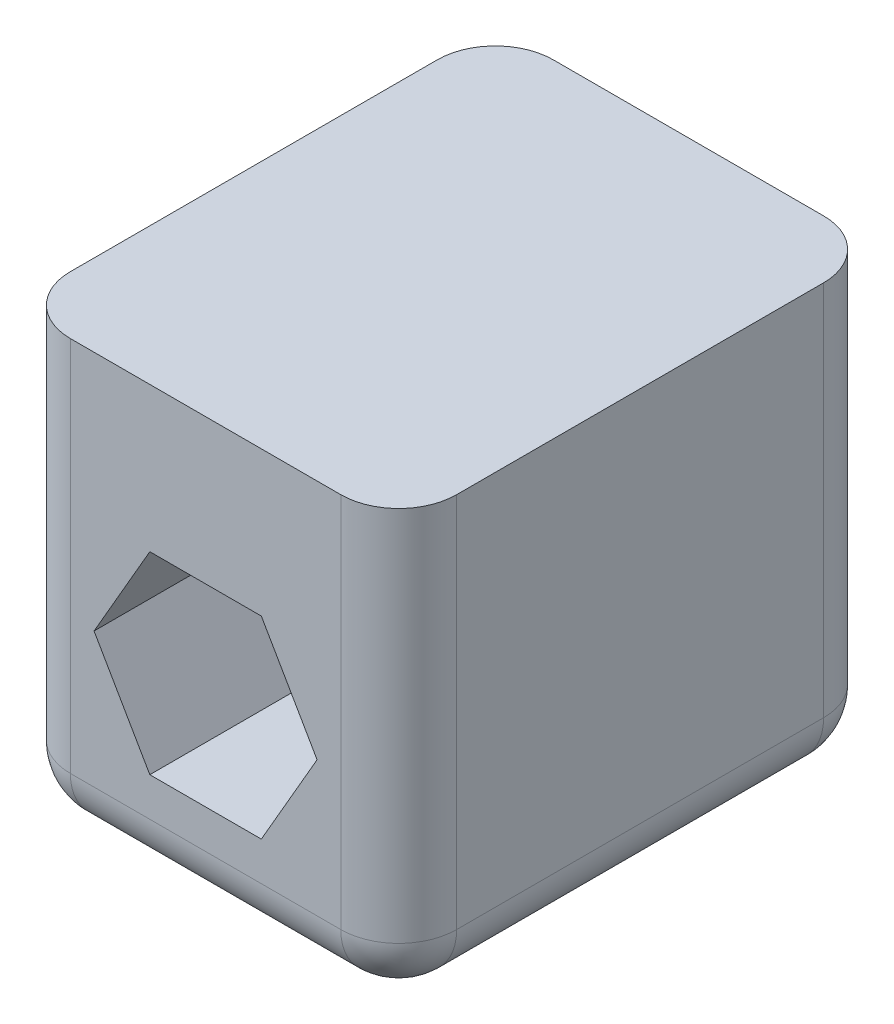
ISO-10303-21;
HEADER;
FILE_DESCRIPTION(('STEP AP214'),'2;1');
FILE_NAME('part.step','',(''),(''),'','','');
FILE_SCHEMA(('AUTOMOTIVE_DESIGN { 1 0 10303 214 1 1 1 1 }'));
ENDSEC;
DATA;
#1=APPLICATION_CONTEXT('core data for automotive mechanical design processes');
#2=APPLICATION_PROTOCOL_DEFINITION('international standard','automotive_design',2000,#1);
#3=PRODUCT_CONTEXT('',#1,'mechanical');
#4=PRODUCT('Part','Part','',(#3));
#5=PRODUCT_RELATED_PRODUCT_CATEGORY('part','',(#4));
#6=PRODUCT_DEFINITION_FORMATION('','',#4);
#7=PRODUCT_DEFINITION_CONTEXT('part definition',#1,'design');
#8=PRODUCT_DEFINITION('design','',#6,#7);
#9=PRODUCT_DEFINITION_SHAPE('','',#8);
#10=(LENGTH_UNIT() NAMED_UNIT(*) SI_UNIT(.MILLI.,.METRE.));
#11=(NAMED_UNIT(*) PLANE_ANGLE_UNIT() SI_UNIT($,.RADIAN.));
#12=(NAMED_UNIT(*) SI_UNIT($,.STERADIAN.) SOLID_ANGLE_UNIT());
#13=UNCERTAINTY_MEASURE_WITH_UNIT(LENGTH_MEASURE(1.E-05),#10,'distance_accuracy_value','');
#14=(GEOMETRIC_REPRESENTATION_CONTEXT(3) GLOBAL_UNCERTAINTY_ASSIGNED_CONTEXT((#13)) GLOBAL_UNIT_ASSIGNED_CONTEXT((#10,
#11,#12)) REPRESENTATION_CONTEXT('',''));
#15=CARTESIAN_POINT('',(0.,0.,0.));
#16=DIRECTION('',(0.,0.,1.));
#17=DIRECTION('',(1.,0.,0.));
#18=AXIS2_PLACEMENT_3D('',#15,#16,#17);
#19=CARTESIAN_POINT('',(0.,0.,25.));
#20=DIRECTION('',(0.,0.,-1.));
#21=DIRECTION('',(-1.,0.,0.));
#22=AXIS2_PLACEMENT_3D('',#19,#20,#21);
#23=CYLINDRICAL_SURFACE('',#22,3.2);
#24=CARTESIAN_POINT('',(0.,0.,0.));
#25=DIRECTION('',(0.,0.,1.));
#26=DIRECTION('',(1.,0.,0.));
#27=AXIS2_PLACEMENT_3D('',#24,#25,#26);
#28=CIRCLE('',#27,3.2);
#29=CARTESIAN_POINT('',(3.2,0.,0.));
#30=VERTEX_POINT('',#29);
#31=EDGE_CURVE('E235',#30,#30,#28,.T.);
#32=ORIENTED_EDGE('',*,*,#31,.F.);
#33=EDGE_LOOP('',(#32));
#34=FACE_BOUND('',#33,.T.);
#35=CARTESIAN_POINT('',(0.,0.,15.));
#36=DIRECTION('',(0.,0.,1.));
#37=DIRECTION('',(1.,0.,0.));
#38=AXIS2_PLACEMENT_3D('',#35,#36,#37);
#39=CIRCLE('',#38,3.2);
#40=CARTESIAN_POINT('',(3.2,0.,15.));
#41=VERTEX_POINT('',#40);
#42=EDGE_CURVE('E223',#41,#41,#39,.T.);
#43=ORIENTED_EDGE('',*,*,#42,.T.);
#44=EDGE_LOOP('',(#43));
#45=FACE_BOUND('',#44,.T.);
#46=ADVANCED_FACE('F45',(#34,#45),#23,.F.);
#47=CARTESIAN_POINT('',(0.,0.,25.));
#48=DIRECTION('',(0.,0.,-1.));
#49=DIRECTION('',(-1.,0.,0.));
#50=AXIS2_PLACEMENT_3D('',#47,#48,#49);
#51=PLANE('',#50);
#52=DIRECTION('',(-0.999999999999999,-4.97530298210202E-08,0.));
#53=VECTOR('',#52,1.);
#54=CARTESIAN_POINT('',(-10.,12.4999995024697,25.));
#55=LINE('',#54,#53);
#56=CARTESIAN_POINT('',(7.,12.5000003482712,25.));
#57=VERTEX_POINT('',#56);
#58=CARTESIAN_POINT('',(-7.,12.4999996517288,25.));
#59=VERTEX_POINT('',#58);
#60=EDGE_CURVE('E240',#57,#59,#55,.T.);
#61=ORIENTED_EDGE('',*,*,#60,.T.);
#62=DIRECTION('',(0.,-1.,0.));
#63=VECTOR('',#62,1.);
#64=CARTESIAN_POINT('',(-7.,0.,25.));
#65=LINE('',#64,#63);
#66=CARTESIAN_POINT('',(-7.,-7.,25.));
#67=VERTEX_POINT('',#66);
#68=EDGE_CURVE('E11',#59,#67,#65,.T.);
#69=ORIENTED_EDGE('',*,*,#68,.T.);
#70=DIRECTION('',(1.,0.,0.));
#71=VECTOR('',#70,1.);
#72=CARTESIAN_POINT('',(0.,-7.,25.));
#73=LINE('',#72,#71);
#74=CARTESIAN_POINT('',(7.,-7.,25.));
#75=VERTEX_POINT('',#74);
#76=EDGE_CURVE('E62',#67,#75,#73,.T.);
#77=ORIENTED_EDGE('',*,*,#76,.T.);
#78=DIRECTION('',(0.,1.,0.));
#79=VECTOR('',#78,1.);
#80=CARTESIAN_POINT('',(7.,0.,25.));
#81=LINE('',#80,#79);
#82=EDGE_CURVE('E55',#75,#57,#81,.T.);
#83=ORIENTED_EDGE('',*,*,#82,.T.);
#84=EDGE_LOOP('',(#61,#69,#77,#83));
#85=FACE_BOUND('',#84,.T.);
#86=DIRECTION('',(-0.5,0.866025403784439,0.));
#87=VECTOR('',#86,1.);
#88=CARTESIAN_POINT('',(5.77350269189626,0.,25.));
#89=LINE('',#88,#87);
#90=CARTESIAN_POINT('',(5.77350269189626,0.,25.));
#91=VERTEX_POINT('',#90);
#92=CARTESIAN_POINT('',(2.88675134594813,5.,25.));
#93=VERTEX_POINT('',#92);
#94=EDGE_CURVE('E206',#91,#93,#89,.T.);
#95=ORIENTED_EDGE('',*,*,#94,.F.);
#96=DIRECTION('',(0.5,0.866025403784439,0.));
#97=VECTOR('',#96,1.);
#98=CARTESIAN_POINT('',(2.88675134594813,-5.,25.));
#99=LINE('',#98,#97);
#100=CARTESIAN_POINT('',(2.88675134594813,-5.,25.));
#101=VERTEX_POINT('',#100);
#102=EDGE_CURVE('E165',#101,#91,#99,.T.);
#103=ORIENTED_EDGE('',*,*,#102,.F.);
#104=DIRECTION('',(1.,0.,0.));
#105=VECTOR('',#104,1.);
#106=CARTESIAN_POINT('',(-2.88675134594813,-5.,25.));
#107=LINE('',#106,#105);
#108=CARTESIAN_POINT('',(-2.88675134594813,-5.,25.));
#109=VERTEX_POINT('',#108);
#110=EDGE_CURVE('E186',#109,#101,#107,.T.);
#111=ORIENTED_EDGE('',*,*,#110,.F.);
#112=DIRECTION('',(0.5,-0.866025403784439,0.));
#113=VECTOR('',#112,1.);
#114=CARTESIAN_POINT('',(-5.77350269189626,0.,25.));
#115=LINE('',#114,#113);
#116=CARTESIAN_POINT('',(-5.77350269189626,0.,25.));
#117=VERTEX_POINT('',#116);
#118=EDGE_CURVE('E190',#117,#109,#115,.T.);
#119=ORIENTED_EDGE('',*,*,#118,.F.);
#120=DIRECTION('',(-0.5,-0.866025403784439,0.));
#121=VECTOR('',#120,1.);
#122=CARTESIAN_POINT('',(-2.88675134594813,5.,25.));
#123=LINE('',#122,#121);
#124=CARTESIAN_POINT('',(-2.88675134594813,5.,25.));
#125=VERTEX_POINT('',#124);
#126=EDGE_CURVE('E213',#125,#117,#123,.T.);
#127=ORIENTED_EDGE('',*,*,#126,.F.);
#128=DIRECTION('',(-1.,0.,0.));
#129=VECTOR('',#128,1.);
#130=CARTESIAN_POINT('',(2.88675134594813,5.,25.));
#131=LINE('',#130,#129);
#132=EDGE_CURVE('E209',#93,#125,#131,.T.);
#133=ORIENTED_EDGE('',*,*,#132,.F.);
#134=EDGE_LOOP('',(#95,#103,#111,#119,#127,#133));
#135=FACE_BOUND('',#134,.T.);
#136=ADVANCED_FACE('F368',(#85,#135),#51,.F.);
#137=CARTESIAN_POINT('',(0.,0.,0.));
#138=DIRECTION('',(0.,0.,-1.));
#139=DIRECTION('',(-1.,0.,0.));
#140=AXIS2_PLACEMENT_3D('',#137,#138,#139);
#141=PLANE('',#140);
#142=DIRECTION('',(1.,0.,0.));
#143=VECTOR('',#142,1.);
#144=CARTESIAN_POINT('',(-10.,-7.,0.));
#145=LINE('',#144,#143);
#146=CARTESIAN_POINT('',(7.,-7.,0.));
#147=VERTEX_POINT('',#146);
#148=CARTESIAN_POINT('',(-7.,-7.,0.));
#149=VERTEX_POINT('',#148);
#150=EDGE_CURVE('E267',#147,#149,#145,.F.);
#151=ORIENTED_EDGE('',*,*,#150,.T.);
#152=DIRECTION('',(0.,-1.,0.));
#153=VECTOR('',#152,1.);
#154=CARTESIAN_POINT('',(-7.,12.4999995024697,0.));
#155=LINE('',#154,#153);
#156=CARTESIAN_POINT('',(-7.,12.4999996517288,0.));
#157=VERTEX_POINT('',#156);
#158=EDGE_CURVE('E273',#149,#157,#155,.F.);
#159=ORIENTED_EDGE('',*,*,#158,.T.);
#160=DIRECTION('',(-0.999999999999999,-4.97530298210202E-08,0.));
#161=VECTOR('',#160,1.);
#162=CARTESIAN_POINT('',(-10.,12.4999995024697,0.));
#163=LINE('',#162,#161);
#164=CARTESIAN_POINT('',(7.,12.5000003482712,0.));
#165=VERTEX_POINT('',#164);
#166=EDGE_CURVE('E239',#165,#157,#163,.T.);
#167=ORIENTED_EDGE('',*,*,#166,.F.);
#168=DIRECTION('',(0.,1.,0.));
#169=VECTOR('',#168,1.);
#170=CARTESIAN_POINT('',(7.,-10.,0.));
#171=LINE('',#170,#169);
#172=EDGE_CURVE('E270',#165,#147,#171,.F.);
#173=ORIENTED_EDGE('',*,*,#172,.T.);
#174=EDGE_LOOP('',(#151,#159,#167,#173));
#175=FACE_BOUND('',#174,.T.);
#176=ORIENTED_EDGE('',*,*,#31,.T.);
#177=EDGE_LOOP('',(#176));
#178=FACE_BOUND('',#177,.T.);
#179=ADVANCED_FACE('F404',(#175,#178),#141,.T.);
#180=CARTESIAN_POINT('',(10.,-10.,25.));
#181=DIRECTION('',(-1.,0.,0.));
#182=DIRECTION('',(0.,0.,1.));
#183=AXIS2_PLACEMENT_3D('',#180,#181,#182);
#184=PLANE('',#183);
#185=DIRECTION('',(0.,0.,-1.));
#186=VECTOR('',#185,1.);
#187=CARTESIAN_POINT('',(10.,-7.,25.));
#188=LINE('',#187,#186);
#189=CARTESIAN_POINT('',(10.,-7.,22.));
#190=VERTEX_POINT('',#189);
#191=CARTESIAN_POINT('',(10.,-7.,3.));
#192=VERTEX_POINT('',#191);
#193=EDGE_CURVE('E288',#190,#192,#188,.T.);
#194=ORIENTED_EDGE('',*,*,#193,.T.);
#195=DIRECTION('',(0.,1.,0.));
#196=VECTOR('',#195,1.);
#197=CARTESIAN_POINT('',(10.,12.5000004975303,3.));
#198=LINE('',#197,#196);
#199=CARTESIAN_POINT('',(10.,12.5000004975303,3.));
#200=VERTEX_POINT('',#199);
#201=EDGE_CURVE('E294',#192,#200,#198,.T.);
#202=ORIENTED_EDGE('',*,*,#201,.T.);
#203=DIRECTION('',(0.,0.,-1.));
#204=VECTOR('',#203,1.);
#205=CARTESIAN_POINT('',(10.,12.5000004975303,25.));
#206=LINE('',#205,#204);
#207=CARTESIAN_POINT('',(10.,12.5000004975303,22.));
#208=VERTEX_POINT('',#207);
#209=EDGE_CURVE('E250',#208,#200,#206,.T.);
#210=ORIENTED_EDGE('',*,*,#209,.F.);
#211=DIRECTION('',(0.,1.,0.));
#212=VECTOR('',#211,1.);
#213=CARTESIAN_POINT('',(10.,-10.,22.));
#214=LINE('',#213,#212);
#215=EDGE_CURVE('E291',#208,#190,#214,.F.);
#216=ORIENTED_EDGE('',*,*,#215,.T.);
#217=EDGE_LOOP('',(#194,#202,#210,#216));
#218=FACE_BOUND('',#217,.T.);
#219=ADVANCED_FACE('F394',(#218),#184,.F.);
#220=CARTESIAN_POINT('',(-10.,12.4999995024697,25.));
#221=DIRECTION('',(4.97530298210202E-08,-0.999999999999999,0.));
#222=DIRECTION('',(0.999999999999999,4.97530298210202E-08,0.));
#223=AXIS2_PLACEMENT_3D('',#220,#221,#222);
#224=PLANE('',#223);
#225=ORIENTED_EDGE('',*,*,#166,.T.);
#226=CARTESIAN_POINT('',(-7.,12.4999996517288,3.));
#227=DIRECTION('',(4.97530298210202E-08,-0.999999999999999,0.));
#228=DIRECTION('',(0.999999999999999,4.97530298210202E-08,0.));
#229=AXIS2_PLACEMENT_3D('',#226,#227,#228);
#230=CIRCLE('',#229,3.);
#231=CARTESIAN_POINT('',(-10.,12.4999995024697,3.));
#232=VERTEX_POINT('',#231);
#233=EDGE_CURVE('E285',#157,#232,#230,.F.);
#234=ORIENTED_EDGE('',*,*,#233,.T.);
#235=DIRECTION('',(0.,0.,-1.));
#236=VECTOR('',#235,1.);
#237=CARTESIAN_POINT('',(-10.,12.4999995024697,25.));
#238=LINE('',#237,#236);
#239=CARTESIAN_POINT('',(-10.,12.4999995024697,22.));
#240=VERTEX_POINT('',#239);
#241=EDGE_CURVE('E243',#240,#232,#238,.T.);
#242=ORIENTED_EDGE('',*,*,#241,.F.);
#243=CARTESIAN_POINT('',(-7.,12.4999996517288,22.));
#244=DIRECTION('',(4.97530298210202E-08,-0.999999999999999,0.));
#245=DIRECTION('',(0.999999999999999,4.97530298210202E-08,0.));
#246=AXIS2_PLACEMENT_3D('',#243,#244,#245);
#247=CIRCLE('',#246,3.);
#248=EDGE_CURVE('E279',#240,#59,#247,.F.);
#249=ORIENTED_EDGE('',*,*,#248,.T.);
#250=ORIENTED_EDGE('',*,*,#60,.F.);
#251=CARTESIAN_POINT('',(7.,12.5000003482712,22.));
#252=DIRECTION('',(4.97530298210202E-08,-0.999999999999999,0.));
#253=DIRECTION('',(0.999999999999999,4.97530298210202E-08,0.));
#254=AXIS2_PLACEMENT_3D('',#251,#252,#253);
#255=CIRCLE('',#254,3.);
#256=EDGE_CURVE('E276',#57,#208,#255,.F.);
#257=ORIENTED_EDGE('',*,*,#256,.T.);
#258=ORIENTED_EDGE('',*,*,#209,.T.);
#259=CARTESIAN_POINT('',(7.,12.5000003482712,3.));
#260=DIRECTION('',(4.97530298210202E-08,-0.999999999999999,0.));
#261=DIRECTION('',(0.999999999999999,4.97530298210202E-08,0.));
#262=AXIS2_PLACEMENT_3D('',#259,#260,#261);
#263=CIRCLE('',#262,3.);
#264=EDGE_CURVE('E282',#200,#165,#263,.F.);
#265=ORIENTED_EDGE('',*,*,#264,.T.);
#266=EDGE_LOOP('',(#225,#234,#242,#249,#250,#257,#258,#265));
#267=FACE_BOUND('',#266,.T.);
#268=ADVANCED_FACE('F371',(#267),#224,.F.);
#269=CARTESIAN_POINT('',(-10.,-10.,25.));
#270=DIRECTION('',(1.,0.,0.));
#271=DIRECTION('',(0.,0.,-1.));
#272=AXIS2_PLACEMENT_3D('',#269,#270,#271);
#273=PLANE('',#272);
#274=ORIENTED_EDGE('',*,*,#241,.T.);
#275=DIRECTION('',(0.,-1.,0.));
#276=VECTOR('',#275,1.);
#277=CARTESIAN_POINT('',(-10.,-10.,3.));
#278=LINE('',#277,#276);
#279=CARTESIAN_POINT('',(-10.,-7.,3.));
#280=VERTEX_POINT('',#279);
#281=EDGE_CURVE('E263',#232,#280,#278,.T.);
#282=ORIENTED_EDGE('',*,*,#281,.T.);
#283=DIRECTION('',(0.,0.,-1.));
#284=VECTOR('',#283,1.);
#285=CARTESIAN_POINT('',(-10.,-7.,25.));
#286=LINE('',#285,#284);
#287=CARTESIAN_POINT('',(-10.,-7.,22.));
#288=VERTEX_POINT('',#287);
#289=EDGE_CURVE('E254',#280,#288,#286,.F.);
#290=ORIENTED_EDGE('',*,*,#289,.T.);
#291=DIRECTION('',(0.,-1.,0.));
#292=VECTOR('',#291,1.);
#293=CARTESIAN_POINT('',(-10.,-10.,22.));
#294=LINE('',#293,#292);
#295=EDGE_CURVE('E260',#288,#240,#294,.F.);
#296=ORIENTED_EDGE('',*,*,#295,.T.);
#297=EDGE_LOOP('',(#274,#282,#290,#296));
#298=FACE_BOUND('',#297,.T.);
#299=ADVANCED_FACE('F420',(#298),#273,.F.);
#300=CARTESIAN_POINT('',(-10.,-10.,25.));
#301=DIRECTION('',(0.,1.,0.));
#302=DIRECTION('',(0.,0.,1.));
#303=AXIS2_PLACEMENT_3D('',#300,#301,#302);
#304=PLANE('',#303);
#305=DIRECTION('',(1.,0.,0.));
#306=VECTOR('',#305,1.);
#307=CARTESIAN_POINT('',(10.,-10.,3.));
#308=LINE('',#307,#306);
#309=CARTESIAN_POINT('',(-7.,-10.,3.));
#310=VERTEX_POINT('',#309);
#311=CARTESIAN_POINT('',(7.,-10.,3.));
#312=VERTEX_POINT('',#311);
#313=EDGE_CURVE('E303',#310,#312,#308,.T.);
#314=ORIENTED_EDGE('',*,*,#313,.T.);
#315=DIRECTION('',(0.,0.,-1.));
#316=VECTOR('',#315,1.);
#317=CARTESIAN_POINT('',(7.,-10.,25.));
#318=LINE('',#317,#316);
#319=CARTESIAN_POINT('',(7.,-10.,22.));
#320=VERTEX_POINT('',#319);
#321=EDGE_CURVE('E307',#312,#320,#318,.F.);
#322=ORIENTED_EDGE('',*,*,#321,.T.);
#323=DIRECTION('',(1.,0.,0.));
#324=VECTOR('',#323,1.);
#325=CARTESIAN_POINT('',(-10.,-10.,22.));
#326=LINE('',#325,#324);
#327=CARTESIAN_POINT('',(-7.,-10.,22.));
#328=VERTEX_POINT('',#327);
#329=EDGE_CURVE('E300',#320,#328,#326,.F.);
#330=ORIENTED_EDGE('',*,*,#329,.T.);
#331=DIRECTION('',(0.,0.,-1.));
#332=VECTOR('',#331,1.);
#333=CARTESIAN_POINT('',(-7.,-10.,25.));
#334=LINE('',#333,#332);
#335=EDGE_CURVE('E297',#328,#310,#334,.T.);
#336=ORIENTED_EDGE('',*,*,#335,.T.);
#337=EDGE_LOOP('',(#314,#322,#330,#336));
#338=FACE_BOUND('',#337,.T.);
#339=ADVANCED_FACE('F386',(#338),#304,.F.);
#340=CARTESIAN_POINT('',(2.88675134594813,-5.,15.));
#341=DIRECTION('',(0.866025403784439,-0.5,0.));
#342=DIRECTION('',(0.5,0.866025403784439,0.));
#343=AXIS2_PLACEMENT_3D('',#340,#341,#342);
#344=PLANE('',#343);
#345=ORIENTED_EDGE('',*,*,#102,.T.);
#346=DIRECTION('',(0.,0.,1.));
#347=VECTOR('',#346,1.);
#348=CARTESIAN_POINT('',(5.77350269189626,0.,15.));
#349=LINE('',#348,#347);
#350=CARTESIAN_POINT('',(5.77350269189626,0.,15.));
#351=VERTEX_POINT('',#350);
#352=EDGE_CURVE('E158',#351,#91,#349,.T.);
#353=ORIENTED_EDGE('',*,*,#352,.F.);
#354=DIRECTION('',(0.5,0.866025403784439,0.));
#355=VECTOR('',#354,1.);
#356=CARTESIAN_POINT('',(2.88675134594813,-5.,15.));
#357=LINE('',#356,#355);
#358=CARTESIAN_POINT('',(2.88675134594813,-5.,15.));
#359=VERTEX_POINT('',#358);
#360=EDGE_CURVE('E162',#359,#351,#357,.T.);
#361=ORIENTED_EDGE('',*,*,#360,.F.);
#362=DIRECTION('',(0.,0.,1.));
#363=VECTOR('',#362,1.);
#364=CARTESIAN_POINT('',(2.88675134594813,-5.,15.));
#365=LINE('',#364,#363);
#366=EDGE_CURVE('E220',#359,#101,#365,.T.);
#367=ORIENTED_EDGE('',*,*,#366,.T.);
#368=EDGE_LOOP('',(#345,#353,#361,#367));
#369=FACE_BOUND('',#368,.T.);
#370=ADVANCED_FACE('F160',(#369),#344,.F.);
#371=CARTESIAN_POINT('',(-2.88675134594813,-5.,15.));
#372=DIRECTION('',(0.,-1.,0.));
#373=DIRECTION('',(1.,0.,0.));
#374=AXIS2_PLACEMENT_3D('',#371,#372,#373);
#375=PLANE('',#374);
#376=ORIENTED_EDGE('',*,*,#110,.T.);
#377=ORIENTED_EDGE('',*,*,#366,.F.);
#378=DIRECTION('',(1.,0.,0.));
#379=VECTOR('',#378,1.);
#380=CARTESIAN_POINT('',(-2.88675134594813,-5.,15.));
#381=LINE('',#380,#379);
#382=CARTESIAN_POINT('',(-2.88675134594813,-5.,15.));
#383=VERTEX_POINT('',#382);
#384=EDGE_CURVE('E171',#383,#359,#381,.T.);
#385=ORIENTED_EDGE('',*,*,#384,.F.);
#386=DIRECTION('',(0.,0.,1.));
#387=VECTOR('',#386,1.);
#388=CARTESIAN_POINT('',(-2.88675134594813,-5.,15.));
#389=LINE('',#388,#387);
#390=EDGE_CURVE('E224',#383,#109,#389,.T.);
#391=ORIENTED_EDGE('',*,*,#390,.T.);
#392=EDGE_LOOP('',(#376,#377,#385,#391));
#393=FACE_BOUND('',#392,.T.);
#394=ADVANCED_FACE('F488',(#393),#375,.F.);
#395=CARTESIAN_POINT('',(-5.77350269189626,0.,15.));
#396=DIRECTION('',(-0.866025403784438,-0.5,0.));
#397=DIRECTION('',(0.5,-0.866025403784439,0.));
#398=AXIS2_PLACEMENT_3D('',#395,#396,#397);
#399=PLANE('',#398);
#400=ORIENTED_EDGE('',*,*,#118,.T.);
#401=ORIENTED_EDGE('',*,*,#390,.F.);
#402=DIRECTION('',(0.5,-0.866025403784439,0.));
#403=VECTOR('',#402,1.);
#404=CARTESIAN_POINT('',(-5.77350269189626,0.,15.));
#405=LINE('',#404,#403);
#406=CARTESIAN_POINT('',(-5.77350269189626,0.,15.));
#407=VERTEX_POINT('',#406);
#408=EDGE_CURVE('E199',#407,#383,#405,.T.);
#409=ORIENTED_EDGE('',*,*,#408,.F.);
#410=DIRECTION('',(0.,0.,1.));
#411=VECTOR('',#410,1.);
#412=CARTESIAN_POINT('',(-5.77350269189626,0.,15.));
#413=LINE('',#412,#411);
#414=EDGE_CURVE('E227',#407,#117,#413,.T.);
#415=ORIENTED_EDGE('',*,*,#414,.T.);
#416=EDGE_LOOP('',(#400,#401,#409,#415));
#417=FACE_BOUND('',#416,.T.);
#418=ADVANCED_FACE('F491',(#417),#399,.F.);
#419=CARTESIAN_POINT('',(-2.88675134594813,5.,15.));
#420=DIRECTION('',(-0.866025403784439,0.5,0.));
#421=DIRECTION('',(-0.5,-0.866025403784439,0.));
#422=AXIS2_PLACEMENT_3D('',#419,#420,#421);
#423=PLANE('',#422);
#424=ORIENTED_EDGE('',*,*,#126,.T.);
#425=ORIENTED_EDGE('',*,*,#414,.F.);
#426=DIRECTION('',(-0.5,-0.866025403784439,0.));
#427=VECTOR('',#426,1.);
#428=CARTESIAN_POINT('',(-2.88675134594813,5.,15.));
#429=LINE('',#428,#427);
#430=CARTESIAN_POINT('',(-2.88675134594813,5.,15.));
#431=VERTEX_POINT('',#430);
#432=EDGE_CURVE('E195',#431,#407,#429,.T.);
#433=ORIENTED_EDGE('',*,*,#432,.F.);
#434=DIRECTION('',(0.,0.,1.));
#435=VECTOR('',#434,1.);
#436=CARTESIAN_POINT('',(-2.88675134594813,5.,15.));
#437=LINE('',#436,#435);
#438=EDGE_CURVE('E230',#431,#125,#437,.T.);
#439=ORIENTED_EDGE('',*,*,#438,.T.);
#440=EDGE_LOOP('',(#424,#425,#433,#439));
#441=FACE_BOUND('',#440,.T.);
#442=ADVANCED_FACE('F495',(#441),#423,.F.);
#443=CARTESIAN_POINT('',(2.88675134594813,5.,15.));
#444=DIRECTION('',(0.,1.,0.));
#445=DIRECTION('',(0.,0.,1.));
#446=AXIS2_PLACEMENT_3D('',#443,#444,#445);
#447=PLANE('',#446);
#448=ORIENTED_EDGE('',*,*,#132,.T.);
#449=ORIENTED_EDGE('',*,*,#438,.F.);
#450=DIRECTION('',(-1.,0.,0.));
#451=VECTOR('',#450,1.);
#452=CARTESIAN_POINT('',(2.88675134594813,5.,15.));
#453=LINE('',#452,#451);
#454=CARTESIAN_POINT('',(2.88675134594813,5.,15.));
#455=VERTEX_POINT('',#454);
#456=EDGE_CURVE('E180',#455,#431,#453,.T.);
#457=ORIENTED_EDGE('',*,*,#456,.F.);
#458=DIRECTION('',(0.,0.,1.));
#459=VECTOR('',#458,1.);
#460=CARTESIAN_POINT('',(2.88675134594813,5.,15.));
#461=LINE('',#460,#459);
#462=EDGE_CURVE('E170',#455,#93,#461,.T.);
#463=ORIENTED_EDGE('',*,*,#462,.T.);
#464=EDGE_LOOP('',(#448,#449,#457,#463));
#465=FACE_BOUND('',#464,.T.);
#466=ADVANCED_FACE('F485',(#465),#447,.F.);
#467=CARTESIAN_POINT('',(5.77350269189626,0.,15.));
#468=DIRECTION('',(0.866025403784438,0.5,0.));
#469=DIRECTION('',(-0.5,0.866025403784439,0.));
#470=AXIS2_PLACEMENT_3D('',#467,#468,#469);
#471=PLANE('',#470);
#472=ORIENTED_EDGE('',*,*,#94,.T.);
#473=ORIENTED_EDGE('',*,*,#462,.F.);
#474=DIRECTION('',(-0.5,0.866025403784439,0.));
#475=VECTOR('',#474,1.);
#476=CARTESIAN_POINT('',(5.77350269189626,0.,15.));
#477=LINE('',#476,#475);
#478=EDGE_CURVE('E174',#351,#455,#477,.T.);
#479=ORIENTED_EDGE('',*,*,#478,.F.);
#480=ORIENTED_EDGE('',*,*,#352,.T.);
#481=EDGE_LOOP('',(#472,#473,#479,#480));
#482=FACE_BOUND('',#481,.T.);
#483=ADVANCED_FACE('F175',(#482),#471,.F.);
#484=CARTESIAN_POINT('',(0.,0.,15.));
#485=DIRECTION('',(0.,0.,1.));
#486=DIRECTION('',(1.,0.,0.));
#487=AXIS2_PLACEMENT_3D('',#484,#485,#486);
#488=PLANE('',#487);
#489=ORIENTED_EDGE('',*,*,#42,.F.);
#490=EDGE_LOOP('',(#489));
#491=FACE_BOUND('',#490,.T.);
#492=ORIENTED_EDGE('',*,*,#360,.T.);
#493=ORIENTED_EDGE('',*,*,#478,.T.);
#494=ORIENTED_EDGE('',*,*,#456,.T.);
#495=ORIENTED_EDGE('',*,*,#432,.T.);
#496=ORIENTED_EDGE('',*,*,#408,.T.);
#497=ORIENTED_EDGE('',*,*,#384,.T.);
#498=EDGE_LOOP('',(#492,#493,#494,#495,#496,#497));
#499=FACE_BOUND('',#498,.T.);
#500=ADVANCED_FACE('F182',(#491,#499),#488,.T.);
#501=CARTESIAN_POINT('',(7.,0.,22.));
#502=DIRECTION('',(0.,1.,0.));
#503=DIRECTION('',(0.,0.,1.));
#504=AXIS2_PLACEMENT_3D('',#501,#502,#503);
#505=CYLINDRICAL_SURFACE('',#504,3.);
#506=CARTESIAN_POINT('',(7.,-7.,22.));
#507=DIRECTION('',(0.,-1.,0.));
#508=DIRECTION('',(0.,0.,-1.));
#509=AXIS2_PLACEMENT_3D('',#506,#507,#508);
#510=CIRCLE('',#509,3.);
#511=EDGE_CURVE('E49',#190,#75,#510,.T.);
#512=ORIENTED_EDGE('',*,*,#511,.F.);
#513=ORIENTED_EDGE('',*,*,#215,.F.);
#514=ORIENTED_EDGE('',*,*,#256,.F.);
#515=ORIENTED_EDGE('',*,*,#82,.F.);
#516=EDGE_LOOP('',(#512,#513,#514,#515));
#517=FACE_BOUND('',#516,.T.);
#518=ADVANCED_FACE('F47',(#517),#505,.T.);
#519=CARTESIAN_POINT('',(7.,-7.,22.));
#520=DIRECTION('',(0.,0.,1.));
#521=DIRECTION('',(1.,0.,0.));
#522=AXIS2_PLACEMENT_3D('',#519,#520,#521);
#523=SPHERICAL_SURFACE('',#522,3.);
#524=CARTESIAN_POINT('',(7.,-7.,22.));
#525=DIRECTION('',(0.,0.,1.));
#526=DIRECTION('',(1.,0.,0.));
#527=AXIS2_PLACEMENT_3D('',#524,#525,#526);
#528=CIRCLE('',#527,3.);
#529=EDGE_CURVE('E348',#190,#320,#528,.F.);
#530=ORIENTED_EDGE('',*,*,#529,.F.);
#531=ORIENTED_EDGE('',*,*,#511,.T.);
#532=CARTESIAN_POINT('',(7.,-7.,22.));
#533=DIRECTION('',(1.,0.,0.));
#534=DIRECTION('',(0.,0.,-1.));
#535=AXIS2_PLACEMENT_3D('',#532,#533,#534);
#536=CIRCLE('',#535,3.);
#537=EDGE_CURVE('E351',#320,#75,#536,.F.);
#538=ORIENTED_EDGE('',*,*,#537,.F.);
#539=EDGE_LOOP('',(#530,#531,#538));
#540=FACE_BOUND('',#539,.T.);
#541=ADVANCED_FACE('F362',(#540),#523,.T.);
#542=CARTESIAN_POINT('',(-7.,0.,22.));
#543=DIRECTION('',(0.,-1.,0.));
#544=DIRECTION('',(0.,0.,-1.));
#545=AXIS2_PLACEMENT_3D('',#542,#543,#544);
#546=CYLINDRICAL_SURFACE('',#545,3.);
#547=ORIENTED_EDGE('',*,*,#248,.F.);
#548=ORIENTED_EDGE('',*,*,#295,.F.);
#549=CARTESIAN_POINT('',(-7.,-7.,22.));
#550=DIRECTION('',(0.,-1.,0.));
#551=DIRECTION('',(0.,0.,-1.));
#552=AXIS2_PLACEMENT_3D('',#549,#550,#551);
#553=CIRCLE('',#552,3.);
#554=EDGE_CURVE('E344',#67,#288,#553,.T.);
#555=ORIENTED_EDGE('',*,*,#554,.F.);
#556=ORIENTED_EDGE('',*,*,#68,.F.);
#557=EDGE_LOOP('',(#547,#548,#555,#556));
#558=FACE_BOUND('',#557,.T.);
#559=ADVANCED_FACE('F377',(#558),#546,.T.);
#560=CARTESIAN_POINT('',(0.,-7.,22.));
#561=DIRECTION('',(1.,0.,0.));
#562=DIRECTION('',(0.,0.,-1.));
#563=AXIS2_PLACEMENT_3D('',#560,#561,#562);
#564=CYLINDRICAL_SURFACE('',#563,3.);
#565=ORIENTED_EDGE('',*,*,#537,.T.);
#566=ORIENTED_EDGE('',*,*,#76,.F.);
#567=CARTESIAN_POINT('',(-7.,-7.,22.));
#568=DIRECTION('',(-1.,0.,0.));
#569=DIRECTION('',(0.,0.,1.));
#570=AXIS2_PLACEMENT_3D('',#567,#568,#569);
#571=CIRCLE('',#570,3.);
#572=EDGE_CURVE('E340',#328,#67,#571,.T.);
#573=ORIENTED_EDGE('',*,*,#572,.F.);
#574=ORIENTED_EDGE('',*,*,#329,.F.);
#575=EDGE_LOOP('',(#565,#566,#573,#574));
#576=FACE_BOUND('',#575,.T.);
#577=ADVANCED_FACE('F384',(#576),#564,.T.);
#578=CARTESIAN_POINT('',(7.,-7.,25.));
#579=DIRECTION('',(0.,0.,-1.));
#580=DIRECTION('',(-1.,0.,0.));
#581=AXIS2_PLACEMENT_3D('',#578,#579,#580);
#582=CYLINDRICAL_SURFACE('',#581,3.);
#583=ORIENTED_EDGE('',*,*,#529,.T.);
#584=ORIENTED_EDGE('',*,*,#321,.F.);
#585=CARTESIAN_POINT('',(7.,-7.,3.));
#586=DIRECTION('',(0.,0.,-1.));
#587=DIRECTION('',(-1.,0.,0.));
#588=AXIS2_PLACEMENT_3D('',#585,#586,#587);
#589=CIRCLE('',#588,3.);
#590=EDGE_CURVE('E336',#192,#312,#589,.T.);
#591=ORIENTED_EDGE('',*,*,#590,.F.);
#592=ORIENTED_EDGE('',*,*,#193,.F.);
#593=EDGE_LOOP('',(#583,#584,#591,#592));
#594=FACE_BOUND('',#593,.T.);
#595=ADVANCED_FACE('F391',(#594),#582,.T.);
#596=CARTESIAN_POINT('',(7.,-10.,3.));
#597=DIRECTION('',(0.,-1.,0.));
#598=DIRECTION('',(0.,0.,-1.));
#599=AXIS2_PLACEMENT_3D('',#596,#597,#598);
#600=CYLINDRICAL_SURFACE('',#599,3.);
#601=ORIENTED_EDGE('',*,*,#264,.F.);
#602=ORIENTED_EDGE('',*,*,#201,.F.);
#603=CARTESIAN_POINT('',(7.,-7.,3.));
#604=DIRECTION('',(0.,-1.,0.));
#605=DIRECTION('',(0.,0.,-1.));
#606=AXIS2_PLACEMENT_3D('',#603,#604,#605);
#607=CIRCLE('',#606,3.);
#608=EDGE_CURVE('E332',#147,#192,#607,.T.);
#609=ORIENTED_EDGE('',*,*,#608,.F.);
#610=ORIENTED_EDGE('',*,*,#172,.F.);
#611=EDGE_LOOP('',(#601,#602,#609,#610));
#612=FACE_BOUND('',#611,.T.);
#613=ADVANCED_FACE('F398',(#612),#600,.T.);
#614=CARTESIAN_POINT('',(-7.,-7.,22.));
#615=DIRECTION('',(0.,0.,1.));
#616=DIRECTION('',(1.,0.,0.));
#617=AXIS2_PLACEMENT_3D('',#614,#615,#616);
#618=SPHERICAL_SURFACE('',#617,3.);
#619=ORIENTED_EDGE('',*,*,#572,.T.);
#620=ORIENTED_EDGE('',*,*,#554,.T.);
#621=CARTESIAN_POINT('',(-7.,-7.,22.));
#622=DIRECTION('',(0.,0.,1.));
#623=DIRECTION('',(1.,0.,0.));
#624=AXIS2_PLACEMENT_3D('',#621,#622,#623);
#625=CIRCLE('',#624,3.);
#626=EDGE_CURVE('E328',#328,#288,#625,.F.);
#627=ORIENTED_EDGE('',*,*,#626,.F.);
#628=EDGE_LOOP('',(#619,#620,#627));
#629=FACE_BOUND('',#628,.T.);
#630=ADVANCED_FACE('F382',(#629),#618,.T.);
#631=CARTESIAN_POINT('',(7.,-7.,3.));
#632=DIRECTION('',(1.,0.,0.));
#633=DIRECTION('',(0.,0.,-1.));
#634=AXIS2_PLACEMENT_3D('',#631,#632,#633);
#635=SPHERICAL_SURFACE('',#634,3.);
#636=ORIENTED_EDGE('',*,*,#608,.T.);
#637=ORIENTED_EDGE('',*,*,#590,.T.);
#638=CARTESIAN_POINT('',(7.,-7.,3.));
#639=DIRECTION('',(1.,0.,0.));
#640=DIRECTION('',(0.,0.,-1.));
#641=AXIS2_PLACEMENT_3D('',#638,#639,#640);
#642=CIRCLE('',#641,3.);
#643=EDGE_CURVE('E325',#147,#312,#642,.F.);
#644=ORIENTED_EDGE('',*,*,#643,.F.);
#645=EDGE_LOOP('',(#636,#637,#644));
#646=FACE_BOUND('',#645,.T.);
#647=ADVANCED_FACE('F460',(#646),#635,.T.);
#648=CARTESIAN_POINT('',(-7.,-7.,25.));
#649=DIRECTION('',(0.,0.,-1.));
#650=DIRECTION('',(-1.,0.,0.));
#651=AXIS2_PLACEMENT_3D('',#648,#649,#650);
#652=CYLINDRICAL_SURFACE('',#651,3.);
#653=ORIENTED_EDGE('',*,*,#626,.T.);
#654=ORIENTED_EDGE('',*,*,#289,.F.);
#655=CARTESIAN_POINT('',(-7.,-7.,3.));
#656=DIRECTION('',(0.,0.,-1.));
#657=DIRECTION('',(-1.,0.,0.));
#658=AXIS2_PLACEMENT_3D('',#655,#656,#657);
#659=CIRCLE('',#658,3.);
#660=EDGE_CURVE('E321',#310,#280,#659,.T.);
#661=ORIENTED_EDGE('',*,*,#660,.F.);
#662=ORIENTED_EDGE('',*,*,#335,.F.);
#663=EDGE_LOOP('',(#653,#654,#661,#662));
#664=FACE_BOUND('',#663,.T.);
#665=ADVANCED_FACE('F418',(#664),#652,.T.);
#666=CARTESIAN_POINT('',(-10.,-7.,3.));
#667=DIRECTION('',(-1.,0.,0.));
#668=DIRECTION('',(0.,0.,1.));
#669=AXIS2_PLACEMENT_3D('',#666,#667,#668);
#670=CYLINDRICAL_SURFACE('',#669,3.);
#671=ORIENTED_EDGE('',*,*,#643,.T.);
#672=ORIENTED_EDGE('',*,*,#313,.F.);
#673=CARTESIAN_POINT('',(-7.,-7.,3.));
#674=DIRECTION('',(-1.,0.,0.));
#675=DIRECTION('',(0.,0.,1.));
#676=AXIS2_PLACEMENT_3D('',#673,#674,#675);
#677=CIRCLE('',#676,3.);
#678=EDGE_CURVE('E317',#149,#310,#677,.T.);
#679=ORIENTED_EDGE('',*,*,#678,.F.);
#680=ORIENTED_EDGE('',*,*,#150,.F.);
#681=EDGE_LOOP('',(#671,#672,#679,#680));
#682=FACE_BOUND('',#681,.T.);
#683=ADVANCED_FACE('F454',(#682),#670,.T.);
#684=CARTESIAN_POINT('',(-7.,-7.,3.));
#685=DIRECTION('',(0.,-1.,0.));
#686=DIRECTION('',(0.,0.,-1.));
#687=AXIS2_PLACEMENT_3D('',#684,#685,#686);
#688=SPHERICAL_SURFACE('',#687,3.);
#689=ORIENTED_EDGE('',*,*,#678,.T.);
#690=ORIENTED_EDGE('',*,*,#660,.T.);
#691=CARTESIAN_POINT('',(-7.,-7.,3.));
#692=DIRECTION('',(0.,-1.,0.));
#693=DIRECTION('',(0.,0.,-1.));
#694=AXIS2_PLACEMENT_3D('',#691,#692,#693);
#695=CIRCLE('',#694,3.);
#696=EDGE_CURVE('E314',#149,#280,#695,.F.);
#697=ORIENTED_EDGE('',*,*,#696,.F.);
#698=EDGE_LOOP('',(#689,#690,#697));
#699=FACE_BOUND('',#698,.T.);
#700=ADVANCED_FACE('F414',(#699),#688,.T.);
#701=CARTESIAN_POINT('',(-7.,-10.,3.));
#702=DIRECTION('',(0.,1.,0.));
#703=DIRECTION('',(0.,0.,1.));
#704=AXIS2_PLACEMENT_3D('',#701,#702,#703);
#705=CYLINDRICAL_SURFACE('',#704,3.);
#706=ORIENTED_EDGE('',*,*,#233,.F.);
#707=ORIENTED_EDGE('',*,*,#158,.F.);
#708=ORIENTED_EDGE('',*,*,#696,.T.);
#709=ORIENTED_EDGE('',*,*,#281,.F.);
#710=EDGE_LOOP('',(#706,#707,#708,#709));
#711=FACE_BOUND('',#710,.T.);
#712=ADVANCED_FACE('F411',(#711),#705,.T.);
#713=CLOSED_SHELL('',(#46,#136,#179,#219,#268,#299,#339,#370,#394,#418,#442,#466,#483,#500,#518,
#541,#559,#577,#595,#613,#630,#647,#665,#683,#700,#712));
#714=MANIFOLD_SOLID_BREP('B2',#713);
#715=ADVANCED_BREP_SHAPE_REPRESENTATION('',(#18,#714),#14);
#716=SHAPE_DEFINITION_REPRESENTATION(#9,#715);
ENDSEC;
END-ISO-10303-21;
